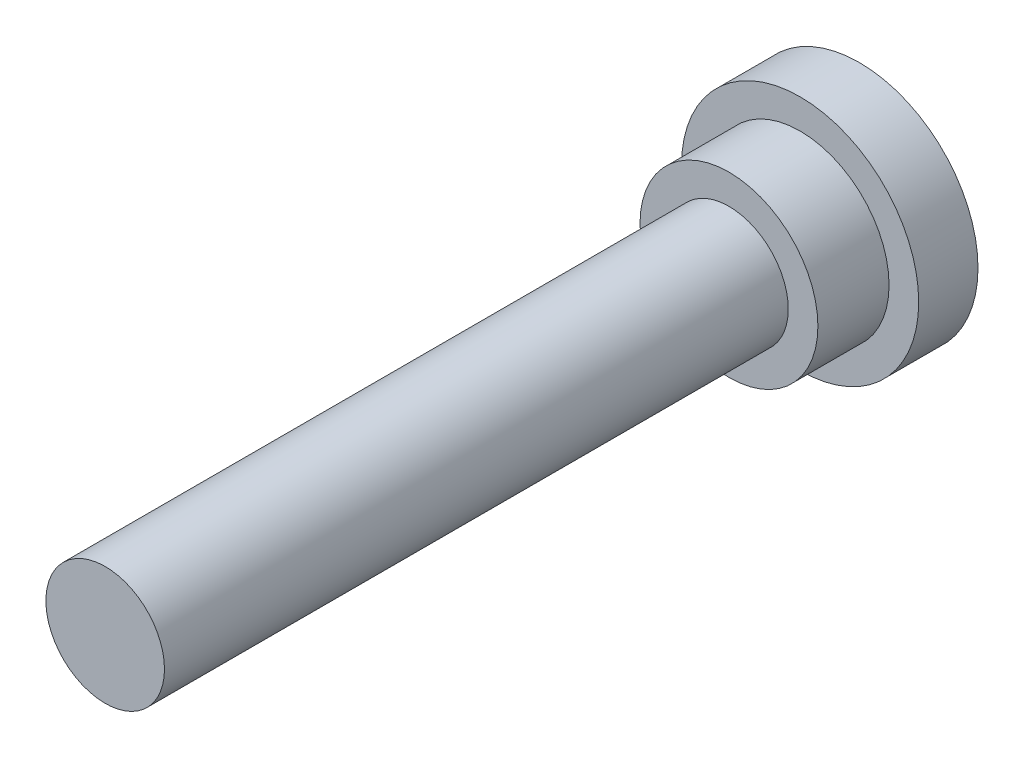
ISO-10303-21;
HEADER;
FILE_DESCRIPTION(('STEP AP214'),'2;1');
FILE_NAME('part.step','',(''),(''),'','','');
FILE_SCHEMA(('AUTOMOTIVE_DESIGN { 1 0 10303 214 1 1 1 1 }'));
ENDSEC;
DATA;
#1=APPLICATION_CONTEXT('core data for automotive mechanical design processes');
#2=APPLICATION_PROTOCOL_DEFINITION('international standard','automotive_design',2000,#1);
#3=PRODUCT_CONTEXT('',#1,'mechanical');
#4=PRODUCT('Part','Part','',(#3));
#5=PRODUCT_RELATED_PRODUCT_CATEGORY('part','',(#4));
#6=PRODUCT_DEFINITION_FORMATION('','',#4);
#7=PRODUCT_DEFINITION_CONTEXT('part definition',#1,'design');
#8=PRODUCT_DEFINITION('design','',#6,#7);
#9=PRODUCT_DEFINITION_SHAPE('','',#8);
#10=(LENGTH_UNIT() NAMED_UNIT(*) SI_UNIT(.MILLI.,.METRE.));
#11=(NAMED_UNIT(*) PLANE_ANGLE_UNIT() SI_UNIT($,.RADIAN.));
#12=(NAMED_UNIT(*) SI_UNIT($,.STERADIAN.) SOLID_ANGLE_UNIT());
#13=UNCERTAINTY_MEASURE_WITH_UNIT(LENGTH_MEASURE(1.E-05),#10,'distance_accuracy_value','');
#14=(GEOMETRIC_REPRESENTATION_CONTEXT(3) GLOBAL_UNCERTAINTY_ASSIGNED_CONTEXT((#13)) GLOBAL_UNIT_ASSIGNED_CONTEXT((#10,
#11,#12)) REPRESENTATION_CONTEXT('',''));
#15=CARTESIAN_POINT('',(0.,0.,0.));
#16=DIRECTION('',(0.,0.,1.));
#17=DIRECTION('',(1.,0.,0.));
#18=AXIS2_PLACEMENT_3D('',#15,#16,#17);
#19=CARTESIAN_POINT('',(0.,0.,63.6));
#20=DIRECTION('',(0.,0.,1.));
#21=DIRECTION('',(1.,0.,0.));
#22=AXIS2_PLACEMENT_3D('',#19,#20,#21);
#23=PLANE('',#22);
#24=CARTESIAN_POINT('',(0.,0.,63.6));
#25=DIRECTION('',(0.,0.,1.));
#26=DIRECTION('',(1.,0.,0.));
#27=AXIS2_PLACEMENT_3D('',#24,#25,#26);
#28=CIRCLE('',#27,5.);
#29=CARTESIAN_POINT('',(5.,0.,63.6));
#30=VERTEX_POINT('',#29);
#31=EDGE_CURVE('E8',#30,#30,#28,.T.);
#32=ORIENTED_EDGE('',*,*,#31,.T.);
#33=EDGE_LOOP('',(#32));
#34=FACE_BOUND('',#33,.T.);
#35=ADVANCED_FACE('F12',(#34),#23,.T.);
#36=CARTESIAN_POINT('',(0.,0.,30.));
#37=DIRECTION('',(0.,0.,1.));
#38=DIRECTION('',(1.,0.,0.));
#39=AXIS2_PLACEMENT_3D('',#36,#37,#38);
#40=CYLINDRICAL_SURFACE('',#39,5.);
#41=CARTESIAN_POINT('',(0.,0.,11.));
#42=DIRECTION('',(0.,0.,1.));
#43=DIRECTION('',(1.,0.,0.));
#44=AXIS2_PLACEMENT_3D('',#41,#42,#43);
#45=CIRCLE('',#44,5.);
#46=CARTESIAN_POINT('',(5.,0.,11.));
#47=VERTEX_POINT('',#46);
#48=EDGE_CURVE('E18',#47,#47,#45,.T.);
#49=ORIENTED_EDGE('',*,*,#48,.T.);
#50=EDGE_LOOP('',(#49));
#51=FACE_BOUND('',#50,.T.);
#52=ORIENTED_EDGE('',*,*,#31,.F.);
#53=EDGE_LOOP('',(#52));
#54=FACE_BOUND('',#53,.T.);
#55=ADVANCED_FACE('F52',(#51,#54),#40,.T.);
#56=CARTESIAN_POINT('',(-5.,0.,11.));
#57=DIRECTION('',(0.,0.,1.));
#58=DIRECTION('',(1.,0.,0.));
#59=AXIS2_PLACEMENT_3D('',#56,#57,#58);
#60=PLANE('',#59);
#61=CARTESIAN_POINT('',(0.,0.,11.));
#62=DIRECTION('',(0.,0.,1.));
#63=DIRECTION('',(1.,0.,0.));
#64=AXIS2_PLACEMENT_3D('',#61,#62,#63);
#65=CIRCLE('',#64,7.5);
#66=CARTESIAN_POINT('',(7.5,0.,11.));
#67=VERTEX_POINT('',#66);
#68=EDGE_CURVE('E22',#67,#67,#65,.T.);
#69=ORIENTED_EDGE('',*,*,#68,.T.);
#70=EDGE_LOOP('',(#69));
#71=FACE_BOUND('',#70,.T.);
#72=ORIENTED_EDGE('',*,*,#48,.F.);
#73=EDGE_LOOP('',(#72));
#74=FACE_BOUND('',#73,.T.);
#75=ADVANCED_FACE('F57',(#71,#74),#60,.T.);
#76=CARTESIAN_POINT('',(0.,0.,30.));
#77=DIRECTION('',(0.,0.,1.));
#78=DIRECTION('',(1.,0.,0.));
#79=AXIS2_PLACEMENT_3D('',#76,#77,#78);
#80=CYLINDRICAL_SURFACE('',#79,7.5);
#81=CARTESIAN_POINT('',(0.,0.,5.));
#82=DIRECTION('',(0.,0.,1.));
#83=DIRECTION('',(1.,0.,0.));
#84=AXIS2_PLACEMENT_3D('',#81,#82,#83);
#85=CIRCLE('',#84,7.5);
#86=CARTESIAN_POINT('',(7.5,0.,5.));
#87=VERTEX_POINT('',#86);
#88=EDGE_CURVE('E26',#87,#87,#85,.T.);
#89=ORIENTED_EDGE('',*,*,#88,.T.);
#90=EDGE_LOOP('',(#89));
#91=FACE_BOUND('',#90,.T.);
#92=ORIENTED_EDGE('',*,*,#68,.F.);
#93=EDGE_LOOP('',(#92));
#94=FACE_BOUND('',#93,.T.);
#95=ADVANCED_FACE('F62',(#91,#94),#80,.T.);
#96=CARTESIAN_POINT('',(-7.5,0.,5.));
#97=DIRECTION('',(0.,0.,1.));
#98=DIRECTION('',(1.,0.,0.));
#99=AXIS2_PLACEMENT_3D('',#96,#97,#98);
#100=PLANE('',#99);
#101=CARTESIAN_POINT('',(0.,0.,5.));
#102=DIRECTION('',(0.,0.,1.));
#103=DIRECTION('',(1.,0.,0.));
#104=AXIS2_PLACEMENT_3D('',#101,#102,#103);
#105=CIRCLE('',#104,10.);
#106=CARTESIAN_POINT('',(10.,0.,5.));
#107=VERTEX_POINT('',#106);
#108=EDGE_CURVE('E31',#107,#107,#105,.T.);
#109=ORIENTED_EDGE('',*,*,#108,.T.);
#110=EDGE_LOOP('',(#109));
#111=FACE_BOUND('',#110,.T.);
#112=ORIENTED_EDGE('',*,*,#88,.F.);
#113=EDGE_LOOP('',(#112));
#114=FACE_BOUND('',#113,.T.);
#115=ADVANCED_FACE('F49',(#111,#114),#100,.T.);
#116=CARTESIAN_POINT('',(0.,0.,30.));
#117=DIRECTION('',(0.,0.,1.));
#118=DIRECTION('',(1.,0.,0.));
#119=AXIS2_PLACEMENT_3D('',#116,#117,#118);
#120=CYLINDRICAL_SURFACE('',#119,10.);
#121=CARTESIAN_POINT('',(0.,0.,0.));
#122=DIRECTION('',(0.,0.,1.));
#123=DIRECTION('',(1.,0.,0.));
#124=AXIS2_PLACEMENT_3D('',#121,#122,#123);
#125=CIRCLE('',#124,10.);
#126=CARTESIAN_POINT('',(10.,0.,0.));
#127=VERTEX_POINT('',#126);
#128=EDGE_CURVE('E34',#127,#127,#125,.T.);
#129=ORIENTED_EDGE('',*,*,#128,.T.);
#130=EDGE_LOOP('',(#129));
#131=FACE_BOUND('',#130,.T.);
#132=ORIENTED_EDGE('',*,*,#108,.F.);
#133=EDGE_LOOP('',(#132));
#134=FACE_BOUND('',#133,.T.);
#135=ADVANCED_FACE('F38',(#131,#134),#120,.T.);
#136=CARTESIAN_POINT('',(-10.,0.,0.));
#137=DIRECTION('',(0.,0.,-1.));
#138=DIRECTION('',(-1.,0.,0.));
#139=AXIS2_PLACEMENT_3D('',#136,#137,#138);
#140=PLANE('',#139);
#141=ORIENTED_EDGE('',*,*,#128,.F.);
#142=EDGE_LOOP('',(#141));
#143=FACE_BOUND('',#142,.T.);
#144=ADVANCED_FACE('F41',(#143),#140,.T.);
#145=CLOSED_SHELL('',(#35,#55,#75,#95,#115,#135,#144));
#146=MANIFOLD_SOLID_BREP('B1',#145);
#147=ADVANCED_BREP_SHAPE_REPRESENTATION('',(#18,#146),#14);
#148=SHAPE_DEFINITION_REPRESENTATION(#9,#147);
ENDSEC;
END-ISO-10303-21;
